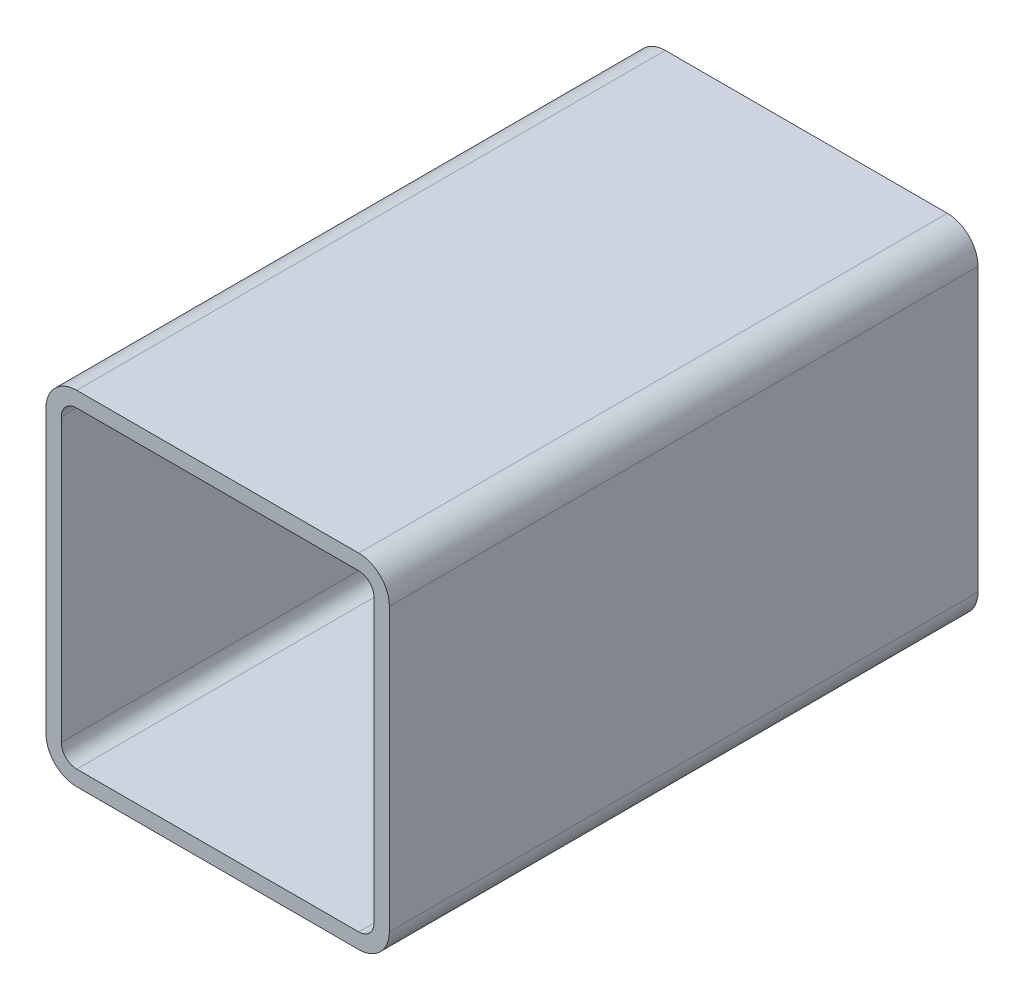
ISO-10303-21;
HEADER;
FILE_DESCRIPTION(('STEP AP214'),'2;1');
FILE_NAME('part.step','',(''),(''),'','','');
FILE_SCHEMA(('AUTOMOTIVE_DESIGN { 1 0 10303 214 1 1 1 1 }'));
ENDSEC;
DATA;
#1=APPLICATION_CONTEXT('core data for automotive mechanical design processes');
#2=APPLICATION_PROTOCOL_DEFINITION('international standard','automotive_design',2000,#1);
#3=PRODUCT_CONTEXT('',#1,'mechanical');
#4=PRODUCT('Part','Part','',(#3));
#5=PRODUCT_RELATED_PRODUCT_CATEGORY('part','',(#4));
#6=PRODUCT_DEFINITION_FORMATION('','',#4);
#7=PRODUCT_DEFINITION_CONTEXT('part definition',#1,'design');
#8=PRODUCT_DEFINITION('design','',#6,#7);
#9=PRODUCT_DEFINITION_SHAPE('','',#8);
#10=(LENGTH_UNIT() NAMED_UNIT(*) SI_UNIT(.MILLI.,.METRE.));
#11=(NAMED_UNIT(*) PLANE_ANGLE_UNIT() SI_UNIT($,.RADIAN.));
#12=(NAMED_UNIT(*) SI_UNIT($,.STERADIAN.) SOLID_ANGLE_UNIT());
#13=UNCERTAINTY_MEASURE_WITH_UNIT(LENGTH_MEASURE(1.E-05),#10,'distance_accuracy_value','');
#14=(GEOMETRIC_REPRESENTATION_CONTEXT(3) GLOBAL_UNCERTAINTY_ASSIGNED_CONTEXT((#13)) GLOBAL_UNIT_ASSIGNED_CONTEXT((#10,
#11,#12)) REPRESENTATION_CONTEXT('',''));
#15=CARTESIAN_POINT('',(0.,0.,0.));
#16=DIRECTION('',(0.,0.,1.));
#17=DIRECTION('',(1.,0.,0.));
#18=AXIS2_PLACEMENT_3D('',#15,#16,#17);
#19=CARTESIAN_POINT('',(18.0798786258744,163.914039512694,304.8));
#20=DIRECTION('',(0.,0.,1.));
#21=DIRECTION('',(1.,0.,0.));
#22=AXIS2_PLACEMENT_3D('',#19,#20,#21);
#23=PLANE('',#22);
#24=CARTESIAN_POINT('',(18.0798786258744,163.914039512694,304.8));
#25=DIRECTION('',(0.,0.,1.));
#26=DIRECTION('',(1.,0.,0.));
#27=AXIS2_PLACEMENT_3D('',#24,#25,#26);
#28=CIRCLE('',#27,15.875);
#29=CARTESIAN_POINT('',(18.0798786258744,179.789039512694,304.8));
#30=VERTEX_POINT('',#29);
#31=CARTESIAN_POINT('',(2.20487862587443,163.914039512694,304.8));
#32=VERTEX_POINT('',#31);
#33=EDGE_CURVE('E211',#30,#32,#28,.T.);
#34=ORIENTED_EDGE('',*,*,#33,.T.);
#35=DIRECTION('',(0.,-1.,0.));
#36=VECTOR('',#35,1.);
#37=CARTESIAN_POINT('',(2.20487862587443,17.8640395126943,304.8));
#38=LINE('',#37,#36);
#39=CARTESIAN_POINT('',(2.20487862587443,17.8640395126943,304.8));
#40=VERTEX_POINT('',#39);
#41=EDGE_CURVE('E214',#32,#40,#38,.T.);
#42=ORIENTED_EDGE('',*,*,#41,.T.);
#43=CARTESIAN_POINT('',(18.0798786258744,17.8640395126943,304.8));
#44=DIRECTION('',(0.,0.,1.));
#45=DIRECTION('',(1.,0.,0.));
#46=AXIS2_PLACEMENT_3D('',#43,#44,#45);
#47=CIRCLE('',#46,15.875);
#48=CARTESIAN_POINT('',(18.0798786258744,1.98903951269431,304.8));
#49=VERTEX_POINT('',#48);
#50=EDGE_CURVE('E217',#40,#49,#47,.T.);
#51=ORIENTED_EDGE('',*,*,#50,.T.);
#52=DIRECTION('',(1.,0.,0.));
#53=VECTOR('',#52,1.);
#54=CARTESIAN_POINT('',(164.129878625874,1.98903951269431,304.8));
#55=LINE('',#54,#53);
#56=CARTESIAN_POINT('',(164.129878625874,1.9890395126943,304.8));
#57=VERTEX_POINT('',#56);
#58=EDGE_CURVE('E219',#49,#57,#55,.T.);
#59=ORIENTED_EDGE('',*,*,#58,.T.);
#60=CARTESIAN_POINT('',(164.129878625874,17.8640395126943,304.8));
#61=DIRECTION('',(0.,0.,1.));
#62=DIRECTION('',(1.,0.,0.));
#63=AXIS2_PLACEMENT_3D('',#60,#61,#62);
#64=CIRCLE('',#63,15.875);
#65=CARTESIAN_POINT('',(180.004878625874,17.8640395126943,304.8));
#66=VERTEX_POINT('',#65);
#67=EDGE_CURVE('E221',#57,#66,#64,.T.);
#68=ORIENTED_EDGE('',*,*,#67,.T.);
#69=DIRECTION('',(0.,1.,0.));
#70=VECTOR('',#69,1.);
#71=CARTESIAN_POINT('',(180.004878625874,163.914039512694,304.8));
#72=LINE('',#71,#70);
#73=CARTESIAN_POINT('',(180.004878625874,163.914039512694,304.8));
#74=VERTEX_POINT('',#73);
#75=EDGE_CURVE('E223',#66,#74,#72,.T.);
#76=ORIENTED_EDGE('',*,*,#75,.T.);
#77=CARTESIAN_POINT('',(164.129878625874,163.914039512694,304.8));
#78=DIRECTION('',(0.,0.,1.));
#79=DIRECTION('',(1.,0.,0.));
#80=AXIS2_PLACEMENT_3D('',#77,#78,#79);
#81=CIRCLE('',#80,15.875);
#82=CARTESIAN_POINT('',(164.129878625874,179.789039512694,304.8));
#83=VERTEX_POINT('',#82);
#84=EDGE_CURVE('E225',#74,#83,#81,.T.);
#85=ORIENTED_EDGE('',*,*,#84,.T.);
#86=DIRECTION('',(-1.,0.,0.));
#87=VECTOR('',#86,1.);
#88=CARTESIAN_POINT('',(18.0798786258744,179.789039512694,304.8));
#89=LINE('',#88,#87);
#90=EDGE_CURVE('E227',#83,#30,#89,.T.);
#91=ORIENTED_EDGE('',*,*,#90,.T.);
#92=EDGE_LOOP('',(#34,#42,#51,#59,#68,#76,#85,#91));
#93=FACE_BOUND('',#92,.T.);
#94=DIRECTION('',(0.,-1.,0.));
#95=VECTOR('',#94,1.);
#96=CARTESIAN_POINT('',(10.1423786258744,17.8640395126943,304.8));
#97=LINE('',#96,#95);
#98=CARTESIAN_POINT('',(10.1423786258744,163.914039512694,304.8));
#99=VERTEX_POINT('',#98);
#100=CARTESIAN_POINT('',(10.1423786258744,17.8640395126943,304.8));
#101=VERTEX_POINT('',#100);
#102=EDGE_CURVE('E154',#99,#101,#97,.T.);
#103=ORIENTED_EDGE('',*,*,#102,.F.);
#104=CARTESIAN_POINT('',(18.0798786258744,163.914039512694,304.8));
#105=DIRECTION('',(0.,0.,1.));
#106=DIRECTION('',(1.,0.,0.));
#107=AXIS2_PLACEMENT_3D('',#104,#105,#106);
#108=CIRCLE('',#107,7.93750000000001);
#109=CARTESIAN_POINT('',(18.0798786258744,171.851539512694,304.8));
#110=VERTEX_POINT('',#109);
#111=EDGE_CURVE('E146',#110,#99,#108,.T.);
#112=ORIENTED_EDGE('',*,*,#111,.F.);
#113=DIRECTION('',(-1.,0.,0.));
#114=VECTOR('',#113,1.);
#115=CARTESIAN_POINT('',(18.0798786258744,171.851539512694,304.8));
#116=LINE('',#115,#114);
#117=CARTESIAN_POINT('',(164.129878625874,171.851539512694,304.8));
#118=VERTEX_POINT('',#117);
#119=EDGE_CURVE('E179',#118,#110,#116,.T.);
#120=ORIENTED_EDGE('',*,*,#119,.F.);
#121=CARTESIAN_POINT('',(164.129878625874,163.914039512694,304.8));
#122=DIRECTION('',(0.,0.,1.));
#123=DIRECTION('',(1.,0.,0.));
#124=AXIS2_PLACEMENT_3D('',#121,#122,#123);
#125=CIRCLE('',#124,7.93750000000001);
#126=CARTESIAN_POINT('',(172.067378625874,163.914039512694,304.8));
#127=VERTEX_POINT('',#126);
#128=EDGE_CURVE('E177',#127,#118,#125,.T.);
#129=ORIENTED_EDGE('',*,*,#128,.F.);
#130=DIRECTION('',(0.,1.,0.));
#131=VECTOR('',#130,1.);
#132=CARTESIAN_POINT('',(172.067378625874,163.914039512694,304.8));
#133=LINE('',#132,#131);
#134=CARTESIAN_POINT('',(172.067378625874,17.8640395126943,304.8));
#135=VERTEX_POINT('',#134);
#136=EDGE_CURVE('E175',#135,#127,#133,.T.);
#137=ORIENTED_EDGE('',*,*,#136,.F.);
#138=CARTESIAN_POINT('',(164.129878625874,17.8640395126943,304.8));
#139=DIRECTION('',(0.,0.,1.));
#140=DIRECTION('',(1.,0.,0.));
#141=AXIS2_PLACEMENT_3D('',#138,#139,#140);
#142=CIRCLE('',#141,7.93750000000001);
#143=CARTESIAN_POINT('',(164.129878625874,9.9265395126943,304.8));
#144=VERTEX_POINT('',#143);
#145=EDGE_CURVE('E173',#144,#135,#142,.T.);
#146=ORIENTED_EDGE('',*,*,#145,.F.);
#147=DIRECTION('',(1.,0.,0.));
#148=VECTOR('',#147,1.);
#149=CARTESIAN_POINT('',(164.129878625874,9.92653951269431,304.8));
#150=LINE('',#149,#148);
#151=CARTESIAN_POINT('',(18.0798786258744,9.92653951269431,304.8));
#152=VERTEX_POINT('',#151);
#153=EDGE_CURVE('E169',#152,#144,#150,.T.);
#154=ORIENTED_EDGE('',*,*,#153,.F.);
#155=CARTESIAN_POINT('',(18.0798786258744,17.8640395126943,304.8));
#156=DIRECTION('',(0.,0.,1.));
#157=DIRECTION('',(1.,0.,0.));
#158=AXIS2_PLACEMENT_3D('',#155,#156,#157);
#159=CIRCLE('',#158,7.9375);
#160=EDGE_CURVE('E167',#101,#152,#159,.T.);
#161=ORIENTED_EDGE('',*,*,#160,.F.);
#162=EDGE_LOOP('',(#103,#112,#120,#129,#137,#146,#154,#161));
#163=FACE_BOUND('',#162,.T.);
#164=ADVANCED_FACE('F33',(#93,#163),#23,.T.);
#165=CARTESIAN_POINT('',(18.0798786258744,163.914039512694,0.));
#166=DIRECTION('',(0.,0.,1.));
#167=DIRECTION('',(1.,0.,0.));
#168=AXIS2_PLACEMENT_3D('',#165,#166,#167);
#169=PLANE('',#168);
#170=CARTESIAN_POINT('',(18.0798786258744,163.914039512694,0.));
#171=DIRECTION('',(0.,0.,1.));
#172=DIRECTION('',(1.,0.,0.));
#173=AXIS2_PLACEMENT_3D('',#170,#171,#172);
#174=CIRCLE('',#173,15.875);
#175=CARTESIAN_POINT('',(18.0798786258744,179.789039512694,0.));
#176=VERTEX_POINT('',#175);
#177=CARTESIAN_POINT('',(2.20487862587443,163.914039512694,0.));
#178=VERTEX_POINT('',#177);
#179=EDGE_CURVE('E162',#176,#178,#174,.T.);
#180=ORIENTED_EDGE('',*,*,#179,.F.);
#181=DIRECTION('',(-1.,0.,0.));
#182=VECTOR('',#181,1.);
#183=CARTESIAN_POINT('',(18.0798786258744,179.789039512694,0.));
#184=LINE('',#183,#182);
#185=CARTESIAN_POINT('',(164.129878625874,179.789039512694,0.));
#186=VERTEX_POINT('',#185);
#187=EDGE_CURVE('E215',#186,#176,#184,.T.);
#188=ORIENTED_EDGE('',*,*,#187,.F.);
#189=CARTESIAN_POINT('',(164.129878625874,163.914039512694,0.));
#190=DIRECTION('',(0.,0.,1.));
#191=DIRECTION('',(1.,0.,0.));
#192=AXIS2_PLACEMENT_3D('',#189,#190,#191);
#193=CIRCLE('',#192,15.875);
#194=CARTESIAN_POINT('',(180.004878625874,163.914039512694,0.));
#195=VERTEX_POINT('',#194);
#196=EDGE_CURVE('E242',#195,#186,#193,.T.);
#197=ORIENTED_EDGE('',*,*,#196,.F.);
#198=DIRECTION('',(0.,1.,0.));
#199=VECTOR('',#198,1.);
#200=CARTESIAN_POINT('',(180.004878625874,163.914039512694,0.));
#201=LINE('',#200,#199);
#202=CARTESIAN_POINT('',(180.004878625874,17.8640395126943,0.));
#203=VERTEX_POINT('',#202);
#204=EDGE_CURVE('E240',#203,#195,#201,.T.);
#205=ORIENTED_EDGE('',*,*,#204,.F.);
#206=CARTESIAN_POINT('',(164.129878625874,17.8640395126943,0.));
#207=DIRECTION('',(0.,0.,1.));
#208=DIRECTION('',(1.,0.,0.));
#209=AXIS2_PLACEMENT_3D('',#206,#207,#208);
#210=CIRCLE('',#209,15.875);
#211=CARTESIAN_POINT('',(164.129878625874,1.9890395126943,0.));
#212=VERTEX_POINT('',#211);
#213=EDGE_CURVE('E238',#212,#203,#210,.T.);
#214=ORIENTED_EDGE('',*,*,#213,.F.);
#215=DIRECTION('',(1.,0.,0.));
#216=VECTOR('',#215,1.);
#217=CARTESIAN_POINT('',(164.129878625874,1.98903951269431,0.));
#218=LINE('',#217,#216);
#219=CARTESIAN_POINT('',(18.0798786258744,1.98903951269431,0.));
#220=VERTEX_POINT('',#219);
#221=EDGE_CURVE('E236',#220,#212,#218,.T.);
#222=ORIENTED_EDGE('',*,*,#221,.F.);
#223=CARTESIAN_POINT('',(18.0798786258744,17.8640395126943,0.));
#224=DIRECTION('',(0.,0.,1.));
#225=DIRECTION('',(1.,0.,0.));
#226=AXIS2_PLACEMENT_3D('',#223,#224,#225);
#227=CIRCLE('',#226,15.875);
#228=CARTESIAN_POINT('',(2.20487862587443,17.8640395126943,0.));
#229=VERTEX_POINT('',#228);
#230=EDGE_CURVE('E234',#229,#220,#227,.T.);
#231=ORIENTED_EDGE('',*,*,#230,.F.);
#232=DIRECTION('',(0.,-1.,0.));
#233=VECTOR('',#232,1.);
#234=CARTESIAN_POINT('',(2.20487862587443,17.8640395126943,0.));
#235=LINE('',#234,#233);
#236=EDGE_CURVE('E232',#178,#229,#235,.T.);
#237=ORIENTED_EDGE('',*,*,#236,.F.);
#238=EDGE_LOOP('',(#180,#188,#197,#205,#214,#222,#231,#237));
#239=FACE_BOUND('',#238,.T.);
#240=CARTESIAN_POINT('',(18.0798786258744,163.914039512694,0.));
#241=DIRECTION('',(0.,0.,1.));
#242=DIRECTION('',(1.,0.,0.));
#243=AXIS2_PLACEMENT_3D('',#240,#241,#242);
#244=CIRCLE('',#243,7.93750000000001);
#245=CARTESIAN_POINT('',(18.0798786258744,171.851539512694,0.));
#246=VERTEX_POINT('',#245);
#247=CARTESIAN_POINT('',(10.1423786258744,163.914039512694,0.));
#248=VERTEX_POINT('',#247);
#249=EDGE_CURVE('E56',#246,#248,#244,.T.);
#250=ORIENTED_EDGE('',*,*,#249,.T.);
#251=DIRECTION('',(0.,-1.,0.));
#252=VECTOR('',#251,1.);
#253=CARTESIAN_POINT('',(10.1423786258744,17.8640395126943,0.));
#254=LINE('',#253,#252);
#255=CARTESIAN_POINT('',(10.1423786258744,17.8640395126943,0.));
#256=VERTEX_POINT('',#255);
#257=EDGE_CURVE('E161',#248,#256,#254,.T.);
#258=ORIENTED_EDGE('',*,*,#257,.T.);
#259=CARTESIAN_POINT('',(18.0798786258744,17.8640395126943,0.));
#260=DIRECTION('',(0.,0.,1.));
#261=DIRECTION('',(1.,0.,0.));
#262=AXIS2_PLACEMENT_3D('',#259,#260,#261);
#263=CIRCLE('',#262,7.9375);
#264=CARTESIAN_POINT('',(18.0798786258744,9.92653951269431,0.));
#265=VERTEX_POINT('',#264);
#266=EDGE_CURVE('E183',#256,#265,#263,.T.);
#267=ORIENTED_EDGE('',*,*,#266,.T.);
#268=DIRECTION('',(1.,0.,0.));
#269=VECTOR('',#268,1.);
#270=CARTESIAN_POINT('',(164.129878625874,9.92653951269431,0.));
#271=LINE('',#270,#269);
#272=CARTESIAN_POINT('',(164.129878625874,9.9265395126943,0.));
#273=VERTEX_POINT('',#272);
#274=EDGE_CURVE('E186',#265,#273,#271,.T.);
#275=ORIENTED_EDGE('',*,*,#274,.T.);
#276=CARTESIAN_POINT('',(164.129878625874,17.8640395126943,0.));
#277=DIRECTION('',(0.,0.,1.));
#278=DIRECTION('',(1.,0.,0.));
#279=AXIS2_PLACEMENT_3D('',#276,#277,#278);
#280=CIRCLE('',#279,7.93750000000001);
#281=CARTESIAN_POINT('',(172.067378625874,17.8640395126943,0.));
#282=VERTEX_POINT('',#281);
#283=EDGE_CURVE('E189',#273,#282,#280,.T.);
#284=ORIENTED_EDGE('',*,*,#283,.T.);
#285=DIRECTION('',(0.,1.,0.));
#286=VECTOR('',#285,1.);
#287=CARTESIAN_POINT('',(172.067378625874,163.914039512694,0.));
#288=LINE('',#287,#286);
#289=CARTESIAN_POINT('',(172.067378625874,163.914039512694,0.));
#290=VERTEX_POINT('',#289);
#291=EDGE_CURVE('E192',#282,#290,#288,.T.);
#292=ORIENTED_EDGE('',*,*,#291,.T.);
#293=CARTESIAN_POINT('',(164.129878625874,163.914039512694,0.));
#294=DIRECTION('',(0.,0.,1.));
#295=DIRECTION('',(1.,0.,0.));
#296=AXIS2_PLACEMENT_3D('',#293,#294,#295);
#297=CIRCLE('',#296,7.93750000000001);
#298=CARTESIAN_POINT('',(164.129878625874,171.851539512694,0.));
#299=VERTEX_POINT('',#298);
#300=EDGE_CURVE('E195',#290,#299,#297,.T.);
#301=ORIENTED_EDGE('',*,*,#300,.T.);
#302=DIRECTION('',(-1.,0.,0.));
#303=VECTOR('',#302,1.);
#304=CARTESIAN_POINT('',(18.0798786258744,171.851539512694,0.));
#305=LINE('',#304,#303);
#306=EDGE_CURVE('E155',#299,#246,#305,.T.);
#307=ORIENTED_EDGE('',*,*,#306,.T.);
#308=EDGE_LOOP('',(#250,#258,#267,#275,#284,#292,#301,#307));
#309=FACE_BOUND('',#308,.T.);
#310=ADVANCED_FACE('F272',(#239,#309),#169,.F.);
#311=CARTESIAN_POINT('',(18.0798786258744,163.914039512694,304.8));
#312=DIRECTION('',(0.,0.,-1.));
#313=DIRECTION('',(-1.,0.,0.));
#314=AXIS2_PLACEMENT_3D('',#311,#312,#313);
#315=CYLINDRICAL_SURFACE('',#314,15.875);
#316=ORIENTED_EDGE('',*,*,#179,.T.);
#317=DIRECTION('',(0.,0.,-1.));
#318=VECTOR('',#317,1.);
#319=CARTESIAN_POINT('',(2.20487862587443,163.914039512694,304.8));
#320=LINE('',#319,#318);
#321=EDGE_CURVE('E11',#32,#178,#320,.T.);
#322=ORIENTED_EDGE('',*,*,#321,.F.);
#323=ORIENTED_EDGE('',*,*,#33,.F.);
#324=DIRECTION('',(0.,0.,-1.));
#325=VECTOR('',#324,1.);
#326=CARTESIAN_POINT('',(18.0798786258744,179.789039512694,304.8));
#327=LINE('',#326,#325);
#328=EDGE_CURVE('E229',#30,#176,#327,.T.);
#329=ORIENTED_EDGE('',*,*,#328,.T.);
#330=EDGE_LOOP('',(#316,#322,#323,#329));
#331=FACE_BOUND('',#330,.T.);
#332=ADVANCED_FACE('F35',(#331),#315,.T.);
#333=CARTESIAN_POINT('',(2.20487862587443,17.8640395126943,304.8));
#334=DIRECTION('',(1.,0.,0.));
#335=DIRECTION('',(0.,0.,-1.));
#336=AXIS2_PLACEMENT_3D('',#333,#334,#335);
#337=PLANE('',#336);
#338=ORIENTED_EDGE('',*,*,#236,.T.);
#339=DIRECTION('',(0.,0.,-1.));
#340=VECTOR('',#339,1.);
#341=CARTESIAN_POINT('',(2.20487862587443,17.8640395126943,304.8));
#342=LINE('',#341,#340);
#343=EDGE_CURVE('E41',#40,#229,#342,.T.);
#344=ORIENTED_EDGE('',*,*,#343,.F.);
#345=ORIENTED_EDGE('',*,*,#41,.F.);
#346=ORIENTED_EDGE('',*,*,#321,.T.);
#347=EDGE_LOOP('',(#338,#344,#345,#346));
#348=FACE_BOUND('',#347,.T.);
#349=ADVANCED_FACE('F289',(#348),#337,.F.);
#350=CARTESIAN_POINT('',(18.0798786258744,17.8640395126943,304.8));
#351=DIRECTION('',(0.,0.,-1.));
#352=DIRECTION('',(-1.,0.,0.));
#353=AXIS2_PLACEMENT_3D('',#350,#351,#352);
#354=CYLINDRICAL_SURFACE('',#353,15.875);
#355=ORIENTED_EDGE('',*,*,#230,.T.);
#356=DIRECTION('',(0.,0.,-1.));
#357=VECTOR('',#356,1.);
#358=CARTESIAN_POINT('',(18.0798786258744,1.98903951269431,304.8));
#359=LINE('',#358,#357);
#360=EDGE_CURVE('E259',#49,#220,#359,.T.);
#361=ORIENTED_EDGE('',*,*,#360,.F.);
#362=ORIENTED_EDGE('',*,*,#50,.F.);
#363=ORIENTED_EDGE('',*,*,#343,.T.);
#364=EDGE_LOOP('',(#355,#361,#362,#363));
#365=FACE_BOUND('',#364,.T.);
#366=ADVANCED_FACE('F266',(#365),#354,.T.);
#367=CARTESIAN_POINT('',(164.129878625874,1.98903951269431,304.8));
#368=DIRECTION('',(0.,1.,0.));
#369=DIRECTION('',(0.,0.,1.));
#370=AXIS2_PLACEMENT_3D('',#367,#368,#369);
#371=PLANE('',#370);
#372=ORIENTED_EDGE('',*,*,#221,.T.);
#373=DIRECTION('',(0.,0.,-1.));
#374=VECTOR('',#373,1.);
#375=CARTESIAN_POINT('',(164.129878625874,1.9890395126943,304.8));
#376=LINE('',#375,#374);
#377=EDGE_CURVE('E256',#57,#212,#376,.T.);
#378=ORIENTED_EDGE('',*,*,#377,.F.);
#379=ORIENTED_EDGE('',*,*,#58,.F.);
#380=ORIENTED_EDGE('',*,*,#360,.T.);
#381=EDGE_LOOP('',(#372,#378,#379,#380));
#382=FACE_BOUND('',#381,.T.);
#383=ADVANCED_FACE('F278',(#382),#371,.F.);
#384=CARTESIAN_POINT('',(164.129878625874,17.8640395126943,304.8));
#385=DIRECTION('',(0.,0.,-1.));
#386=DIRECTION('',(-1.,0.,0.));
#387=AXIS2_PLACEMENT_3D('',#384,#385,#386);
#388=CYLINDRICAL_SURFACE('',#387,15.875);
#389=ORIENTED_EDGE('',*,*,#213,.T.);
#390=DIRECTION('',(0.,0.,-1.));
#391=VECTOR('',#390,1.);
#392=CARTESIAN_POINT('',(180.004878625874,17.8640395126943,304.8));
#393=LINE('',#392,#391);
#394=EDGE_CURVE('E253',#66,#203,#393,.T.);
#395=ORIENTED_EDGE('',*,*,#394,.F.);
#396=ORIENTED_EDGE('',*,*,#67,.F.);
#397=ORIENTED_EDGE('',*,*,#377,.T.);
#398=EDGE_LOOP('',(#389,#395,#396,#397));
#399=FACE_BOUND('',#398,.T.);
#400=ADVANCED_FACE('F282',(#399),#388,.T.);
#401=CARTESIAN_POINT('',(180.004878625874,163.914039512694,304.8));
#402=DIRECTION('',(-1.,0.,0.));
#403=DIRECTION('',(0.,0.,1.));
#404=AXIS2_PLACEMENT_3D('',#401,#402,#403);
#405=PLANE('',#404);
#406=ORIENTED_EDGE('',*,*,#204,.T.);
#407=DIRECTION('',(0.,0.,-1.));
#408=VECTOR('',#407,1.);
#409=CARTESIAN_POINT('',(180.004878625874,163.914039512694,304.8));
#410=LINE('',#409,#408);
#411=EDGE_CURVE('E250',#74,#195,#410,.T.);
#412=ORIENTED_EDGE('',*,*,#411,.F.);
#413=ORIENTED_EDGE('',*,*,#75,.F.);
#414=ORIENTED_EDGE('',*,*,#394,.T.);
#415=EDGE_LOOP('',(#406,#412,#413,#414));
#416=FACE_BOUND('',#415,.T.);
#417=ADVANCED_FACE('F302',(#416),#405,.F.);
#418=CARTESIAN_POINT('',(164.129878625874,163.914039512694,304.8));
#419=DIRECTION('',(0.,0.,-1.));
#420=DIRECTION('',(-1.,0.,0.));
#421=AXIS2_PLACEMENT_3D('',#418,#419,#420);
#422=CYLINDRICAL_SURFACE('',#421,15.875);
#423=ORIENTED_EDGE('',*,*,#196,.T.);
#424=DIRECTION('',(0.,0.,-1.));
#425=VECTOR('',#424,1.);
#426=CARTESIAN_POINT('',(164.129878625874,179.789039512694,304.8));
#427=LINE('',#426,#425);
#428=EDGE_CURVE('E247',#83,#186,#427,.T.);
#429=ORIENTED_EDGE('',*,*,#428,.F.);
#430=ORIENTED_EDGE('',*,*,#84,.F.);
#431=ORIENTED_EDGE('',*,*,#411,.T.);
#432=EDGE_LOOP('',(#423,#429,#430,#431));
#433=FACE_BOUND('',#432,.T.);
#434=ADVANCED_FACE('F300',(#433),#422,.T.);
#435=CARTESIAN_POINT('',(18.0798786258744,179.789039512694,304.8));
#436=DIRECTION('',(0.,-1.,0.));
#437=DIRECTION('',(0.,0.,-1.));
#438=AXIS2_PLACEMENT_3D('',#435,#436,#437);
#439=PLANE('',#438);
#440=ORIENTED_EDGE('',*,*,#187,.T.);
#441=ORIENTED_EDGE('',*,*,#328,.F.);
#442=ORIENTED_EDGE('',*,*,#90,.F.);
#443=ORIENTED_EDGE('',*,*,#428,.T.);
#444=EDGE_LOOP('',(#440,#441,#442,#443));
#445=FACE_BOUND('',#444,.T.);
#446=ADVANCED_FACE('F295',(#445),#439,.F.);
#447=CARTESIAN_POINT('',(18.0798786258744,163.914039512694,304.8));
#448=DIRECTION('',(0.,0.,-1.));
#449=DIRECTION('',(-1.,0.,0.));
#450=AXIS2_PLACEMENT_3D('',#447,#448,#449);
#451=CYLINDRICAL_SURFACE('',#450,7.93750000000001);
#452=ORIENTED_EDGE('',*,*,#249,.F.);
#453=DIRECTION('',(0.,0.,-1.));
#454=VECTOR('',#453,1.);
#455=CARTESIAN_POINT('',(18.0798786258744,171.851539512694,304.8));
#456=LINE('',#455,#454);
#457=EDGE_CURVE('E150',#110,#246,#456,.T.);
#458=ORIENTED_EDGE('',*,*,#457,.F.);
#459=ORIENTED_EDGE('',*,*,#111,.T.);
#460=DIRECTION('',(0.,0.,-1.));
#461=VECTOR('',#460,1.);
#462=CARTESIAN_POINT('',(10.1423786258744,163.914039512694,304.8));
#463=LINE('',#462,#461);
#464=EDGE_CURVE('E149',#99,#248,#463,.T.);
#465=ORIENTED_EDGE('',*,*,#464,.T.);
#466=EDGE_LOOP('',(#452,#458,#459,#465));
#467=FACE_BOUND('',#466,.T.);
#468=ADVANCED_FACE('F148',(#467),#451,.F.);
#469=CARTESIAN_POINT('',(10.1423786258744,17.8640395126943,304.8));
#470=DIRECTION('',(1.,0.,0.));
#471=DIRECTION('',(0.,0.,-1.));
#472=AXIS2_PLACEMENT_3D('',#469,#470,#471);
#473=PLANE('',#472);
#474=ORIENTED_EDGE('',*,*,#257,.F.);
#475=ORIENTED_EDGE('',*,*,#464,.F.);
#476=ORIENTED_EDGE('',*,*,#102,.T.);
#477=DIRECTION('',(0.,0.,-1.));
#478=VECTOR('',#477,1.);
#479=CARTESIAN_POINT('',(10.1423786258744,17.8640395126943,304.8));
#480=LINE('',#479,#478);
#481=EDGE_CURVE('E163',#101,#256,#480,.T.);
#482=ORIENTED_EDGE('',*,*,#481,.T.);
#483=EDGE_LOOP('',(#474,#475,#476,#482));
#484=FACE_BOUND('',#483,.T.);
#485=ADVANCED_FACE('F158',(#484),#473,.T.);
#486=CARTESIAN_POINT('',(18.0798786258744,17.8640395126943,304.8));
#487=DIRECTION('',(0.,0.,-1.));
#488=DIRECTION('',(-1.,0.,0.));
#489=AXIS2_PLACEMENT_3D('',#486,#487,#488);
#490=CYLINDRICAL_SURFACE('',#489,7.9375);
#491=ORIENTED_EDGE('',*,*,#266,.F.);
#492=ORIENTED_EDGE('',*,*,#481,.F.);
#493=ORIENTED_EDGE('',*,*,#160,.T.);
#494=DIRECTION('',(0.,0.,-1.));
#495=VECTOR('',#494,1.);
#496=CARTESIAN_POINT('',(18.0798786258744,9.92653951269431,304.8));
#497=LINE('',#496,#495);
#498=EDGE_CURVE('E208',#152,#265,#497,.T.);
#499=ORIENTED_EDGE('',*,*,#498,.T.);
#500=EDGE_LOOP('',(#491,#492,#493,#499));
#501=FACE_BOUND('',#500,.T.);
#502=ADVANCED_FACE('F327',(#501),#490,.F.);
#503=CARTESIAN_POINT('',(164.129878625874,9.92653951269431,304.8));
#504=DIRECTION('',(0.,1.,0.));
#505=DIRECTION('',(0.,0.,1.));
#506=AXIS2_PLACEMENT_3D('',#503,#504,#505);
#507=PLANE('',#506);
#508=ORIENTED_EDGE('',*,*,#274,.F.);
#509=ORIENTED_EDGE('',*,*,#498,.F.);
#510=ORIENTED_EDGE('',*,*,#153,.T.);
#511=DIRECTION('',(0.,0.,-1.));
#512=VECTOR('',#511,1.);
#513=CARTESIAN_POINT('',(164.129878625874,9.9265395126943,304.8));
#514=LINE('',#513,#512);
#515=EDGE_CURVE('E206',#144,#273,#514,.T.);
#516=ORIENTED_EDGE('',*,*,#515,.T.);
#517=EDGE_LOOP('',(#508,#509,#510,#516));
#518=FACE_BOUND('',#517,.T.);
#519=ADVANCED_FACE('F331',(#518),#507,.T.);
#520=CARTESIAN_POINT('',(164.129878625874,17.8640395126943,304.8));
#521=DIRECTION('',(0.,0.,-1.));
#522=DIRECTION('',(-1.,0.,0.));
#523=AXIS2_PLACEMENT_3D('',#520,#521,#522);
#524=CYLINDRICAL_SURFACE('',#523,7.93750000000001);
#525=ORIENTED_EDGE('',*,*,#283,.F.);
#526=ORIENTED_EDGE('',*,*,#515,.F.);
#527=ORIENTED_EDGE('',*,*,#145,.T.);
#528=DIRECTION('',(0.,0.,-1.));
#529=VECTOR('',#528,1.);
#530=CARTESIAN_POINT('',(172.067378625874,17.8640395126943,304.8));
#531=LINE('',#530,#529);
#532=EDGE_CURVE('E204',#135,#282,#531,.T.);
#533=ORIENTED_EDGE('',*,*,#532,.T.);
#534=EDGE_LOOP('',(#525,#526,#527,#533));
#535=FACE_BOUND('',#534,.T.);
#536=ADVANCED_FACE('F337',(#535),#524,.F.);
#537=CARTESIAN_POINT('',(172.067378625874,163.914039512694,304.8));
#538=DIRECTION('',(-1.,0.,0.));
#539=DIRECTION('',(0.,0.,1.));
#540=AXIS2_PLACEMENT_3D('',#537,#538,#539);
#541=PLANE('',#540);
#542=ORIENTED_EDGE('',*,*,#291,.F.);
#543=ORIENTED_EDGE('',*,*,#532,.F.);
#544=ORIENTED_EDGE('',*,*,#136,.T.);
#545=DIRECTION('',(0.,0.,-1.));
#546=VECTOR('',#545,1.);
#547=CARTESIAN_POINT('',(172.067378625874,163.914039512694,304.8));
#548=LINE('',#547,#546);
#549=EDGE_CURVE('E202',#127,#290,#548,.T.);
#550=ORIENTED_EDGE('',*,*,#549,.T.);
#551=EDGE_LOOP('',(#542,#543,#544,#550));
#552=FACE_BOUND('',#551,.T.);
#553=ADVANCED_FACE('F341',(#552),#541,.T.);
#554=CARTESIAN_POINT('',(164.129878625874,163.914039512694,304.8));
#555=DIRECTION('',(0.,0.,-1.));
#556=DIRECTION('',(-1.,0.,0.));
#557=AXIS2_PLACEMENT_3D('',#554,#555,#556);
#558=CYLINDRICAL_SURFACE('',#557,7.93750000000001);
#559=ORIENTED_EDGE('',*,*,#300,.F.);
#560=ORIENTED_EDGE('',*,*,#549,.F.);
#561=ORIENTED_EDGE('',*,*,#128,.T.);
#562=DIRECTION('',(0.,0.,-1.));
#563=VECTOR('',#562,1.);
#564=CARTESIAN_POINT('',(164.129878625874,171.851539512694,304.8));
#565=LINE('',#564,#563);
#566=EDGE_CURVE('E48',#118,#299,#565,.T.);
#567=ORIENTED_EDGE('',*,*,#566,.T.);
#568=EDGE_LOOP('',(#559,#560,#561,#567));
#569=FACE_BOUND('',#568,.T.);
#570=ADVANCED_FACE('F345',(#569),#558,.F.);
#571=CARTESIAN_POINT('',(18.0798786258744,171.851539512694,304.8));
#572=DIRECTION('',(0.,-1.,0.));
#573=DIRECTION('',(0.,0.,-1.));
#574=AXIS2_PLACEMENT_3D('',#571,#572,#573);
#575=PLANE('',#574);
#576=ORIENTED_EDGE('',*,*,#306,.F.);
#577=ORIENTED_EDGE('',*,*,#566,.F.);
#578=ORIENTED_EDGE('',*,*,#119,.T.);
#579=ORIENTED_EDGE('',*,*,#457,.T.);
#580=EDGE_LOOP('',(#576,#577,#578,#579));
#581=FACE_BOUND('',#580,.T.);
#582=ADVANCED_FACE('F349',(#581),#575,.T.);
#583=CLOSED_SHELL('',(#164,#310,#332,#349,#366,#383,#400,#417,#434,#446,#468,#485,#502,#519,
#536,#553,#570,#582));
#584=MANIFOLD_SOLID_BREP('B2',#583);
#585=ADVANCED_BREP_SHAPE_REPRESENTATION('',(#18,#584),#14);
#586=SHAPE_DEFINITION_REPRESENTATION(#9,#585);
ENDSEC;
END-ISO-10303-21;
